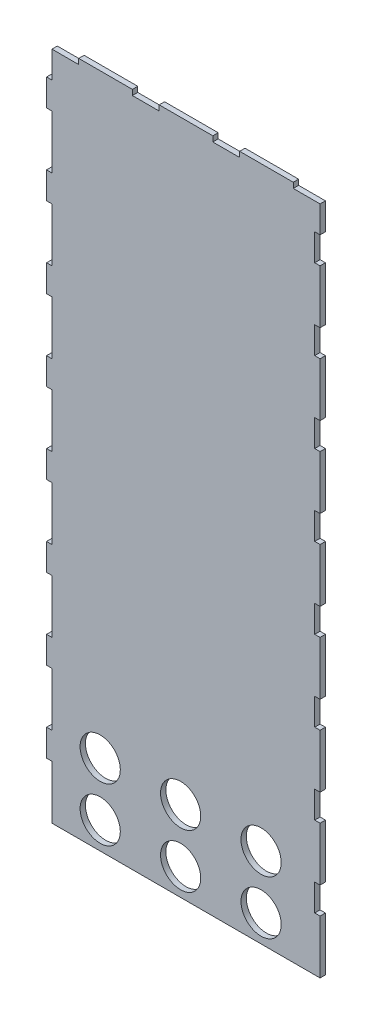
from build123d import *

# Parameters (mm, degrees)
SKETCH1_W           = 100
SKETCH1_H           = 250
SKETCH1_R           = 7.5
BOSS_EXTRUDE1_DEPTH = 2
SKETCH3_W           = 2
SKETCH3_H           = 10
BOSS_EXTRUDE2_DEPTH = 2
LPATTERN1_COUNT     = 8
LPATTERN1_PITCH     = 30
SKETCH4_W           = 2
SKETCH4_H           = 10
CUT_EXTRUDE4_DEPTH  = 2
SKETCH5_W           = 20
SKETCH5_H           = 2
BOSS_EXTRUDE3_DEPTH = 2
LPATTERN2_COUNT     = 3
LPATTERN2_PITCH     = 30


with BuildPart() as part:
    # Sketch1 → Boss-Extrude1 (new body)
    with BuildSketch(Plane.XY):
        Rectangle(SKETCH1_W, SKETCH1_H)
        with Locations((-32, -95)):
            Circle(SKETCH1_R, mode=Mode.SUBTRACT)
        with Locations((-2, -95)):
            Circle(SKETCH1_R, mode=Mode.SUBTRACT)
        with Locations((28, -95)):
            Circle(SKETCH1_R, mode=Mode.SUBTRACT)
        with Locations((-2, -115)):
            Circle(SKETCH1_R, mode=Mode.SUBTRACT)
        with Locations((28, -115)):
            Circle(SKETCH1_R, mode=Mode.SUBTRACT)
        with Locations((-32, -115)):
            Circle(SKETCH1_R, mode=Mode.SUBTRACT)
    extrude(amount=BOSS_EXTRUDE1_DEPTH)

    # Sketch3 → Boss-Extrude2 (add)
    with BuildSketch(Plane.ZY.offset(50)):
        with Locations((1, 110)):
            Rectangle(SKETCH3_W, SKETCH3_H)
    boss_extrude2 = extrude(amount=BOSS_EXTRUDE2_DEPTH)

    # LPattern1: Boss-Extrude2 ×8
    with Locations(*[(0, -i * LPATTERN1_PITCH, 0) for i in range(1, LPATTERN1_COUNT)]):
        add(boss_extrude2)

    # Sketch4 → Cut-Extrude4 (cut)
    with BuildSketch(Plane(origin=(50, 0, 0), x_dir=(0, 0, -1), z_dir=(1, 0, 0))):
        with Locations((-1, -70)):
            Rectangle(SKETCH4_W, SKETCH4_H)
        with Locations((-1, -40)):
            Rectangle(SKETCH4_W, SKETCH4_H)
        with Locations((-1, -10)):
            Rectangle(SKETCH4_W, SKETCH4_H)
        with Locations((-1, 20)):
            Rectangle(SKETCH4_W, SKETCH4_H)
        with Locations((-1, 50)):
            Rectangle(SKETCH4_W, SKETCH4_H)
        with Locations((-1, 80)):
            Rectangle(SKETCH4_W, SKETCH4_H)
        with Locations((-1, 110)):
            Rectangle(SKETCH4_W, SKETCH4_H)
        with Locations((-1, -100)):
            Rectangle(SKETCH4_W, SKETCH4_H)
    extrude(amount=-CUT_EXTRUDE4_DEPTH, mode=Mode.SUBTRACT)

    # Sketch5 → Boss-Extrude3 (add)
    with BuildSketch(Plane(origin=(0, 125, 0), x_dir=(1, 0, 0), z_dir=(0, 1, 0))):
        with Locations((-30, -1)):
            Rectangle(SKETCH5_W, SKETCH5_H)
    boss_extrude3 = extrude(amount=BOSS_EXTRUDE3_DEPTH)

    # LPattern2: Boss-Extrude3 ×3
    with Locations(*[(i * LPATTERN2_PITCH, 0, 0) for i in range(1, LPATTERN2_COUNT)]):
        add(boss_extrude3)


solid = part.part
